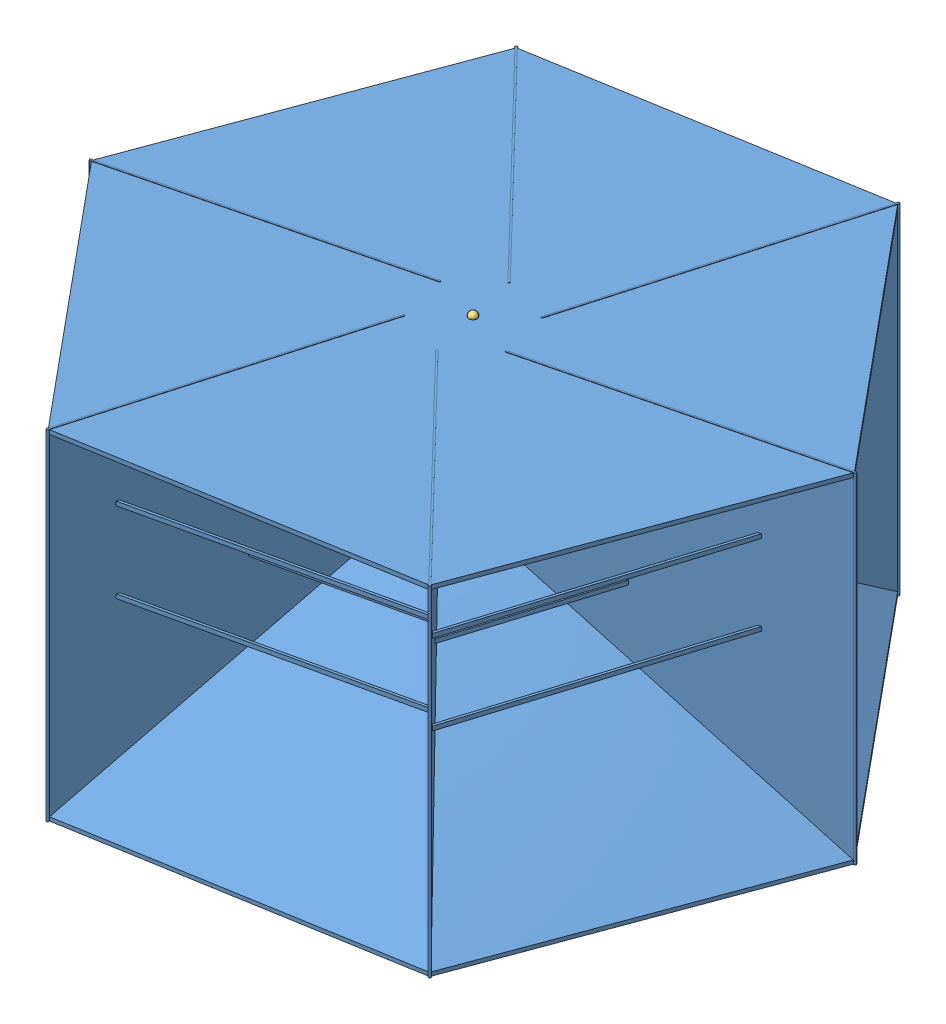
SolidWorks assembly Новый 0.SLDASM, configuration Default (file format 7000). Lengths in mm.
Overall size (7950.93 4175.12 7567.14).
5 component instances, 4 part files, 9 mates.
Components (placement in the parent):
- Новый 2-1: Новый 2.SLDPRT [Default] at (855.1898 4391.5587 6790.3426) size (7950.93 4119.39 7567.14)
- Новый 1-1: Новый 1.SLDPRT [Default] at (1198.1399 5338.8296 7314.6633) x (0.40073 0 -0.916196) z (0.916196 0 0.40073) size (1150 2000 1150)
- Новый 3-1: Новый 3.SLDPRT [Default] at (1427.4698 4338.8296 6790.3426) x (0.593084 0 0.805141) z (-0.805141 0 0.593084) size (300 2515.73 300)
- Новый 4-5: Новый 4.SLDPRT [Default] at (1427.4698 4320.8296 6790.3426) size (200 30 200)
- Новый 4-6: Новый 4.SLDPRT [Default] at (1427.4698 6356.5587 6790.3426) x (-0.856955 0 0.515391) z (-0.515391 0 -0.856955) size (200 30 200)
Mates (geometry in assembly coordinates):
- Coincident1: coincident anti-aligned: plane of Новый 2-1 through (1563.0554 4335.8296 7363.8126) normal (0 1 0); plane of Новый 3-1 through (1427.4698 4335.8296 6790.3426) normal (0 -1 0)
- Coincident4: coincident anti-aligned: plane of Новый 1-1 through (1184.5625 4338.8296 7152.6113) normal (0 -1 0); plane of Новый 3-1 through (1427.4698 4338.8296 6790.3426) normal (0 1 0)
- Coincident9: coincident aligned: circle of Новый 2-1; circle of Новый 4-5
- Coincident10: coincident aligned: plane of Новый 2-1 through (1563.0554 4335.8296 7363.8126) normal (0 1 0); plane of Новый 4-5 through (1427.4698 4335.8296 6790.3426) normal (0 1 0)
- Concentric5: concentric anti-aligned: circle of Новый 3-1; circle of Новый 4-5
- Concentric6: concentric: circle of Новый 3-1; circle of Новый 4-6
- Concentric8: concentric anti-aligned: circle of Новый 1-1; cylinder of Новый 3-1 through (1427.4698 6338.8296 6790.3426) axis (0 -1 0) radius 50
- Concentric9: concentric aligned: circle of Новый 1-1; circle of Новый 3-1
- Coincident11: coincident anti-aligned: plane of Новый 3-1 through (1713.6098 6341.5587 6294.7336) normal (0 1 0); plane of Новый 4-6 through (1427.4698 6341.5587 6790.3426) normal (0 -1 0)
